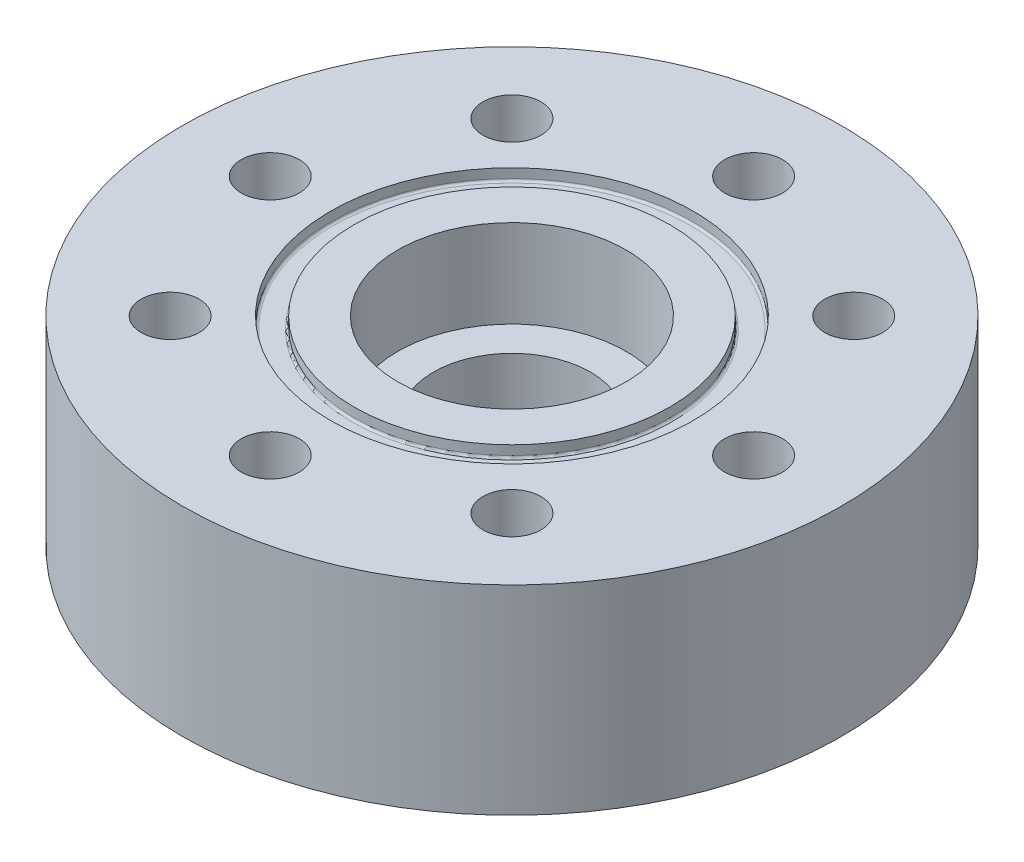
from build123d import *

# Parameters (mm, degrees)
SKETCH2_R                 = 37.5
OUTER_CYLINDER_DEPTH      = 22.7
SKETCH3_R                 = 8.93
NPT_HOLE_DEPTH            = 12.7
SKETCH4_R                 = 3.3
BOLT_HOLES_DEPTH          = 58.687000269
SKETCH5_R                 = 20.6375
SKETCH5_R_2               = 17.9705
O_RING_GROOVE_DEPTH       = 1.3208
FILLET1_R                 = 0.254
SKETCH6_R                 = 13
INLET_FLOW_DIAMETER_DEPTH = 10


with BuildPart() as part:
    # Sketch2 → Outer Cylinder (new body)
    with BuildSketch(Plane(origin=(0, 0, 0), x_dir=(1, 0, 0), z_dir=(0, 1, 0))):
        with Locations(Location((0, 0, 0), (0, 0, 270))):
            Circle(SKETCH2_R)
    extrude(amount=OUTER_CYLINDER_DEPTH)

    # Sketch3 → NPT Hole (cut)
    with BuildSketch(Plane.XZ):
        with Locations(Location((0, 0, 0), (0, 0, 270))):
            Circle(SKETCH3_R)
    extrude(amount=-NPT_HOLE_DEPTH, mode=Mode.SUBTRACT)

    # Sketch4 → Bolt Holes (cut, through all)
    with BuildSketch(Plane.XZ):
        with Locations(Location((-27.5, 0, 0), (0, 0, 270))):
            Circle(SKETCH4_R)
        with Locations(Location((-19.445436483, 19.445436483, 0), (0, 0, 270))):
            Circle(SKETCH4_R)
        with Locations(Location((0, 27.5, 0), (0, 0, 270))):
            Circle(SKETCH4_R)
        with Locations(Location((19.445436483, 19.445436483, 0), (0, 0, 270))):
            Circle(SKETCH4_R)
        with Locations(Location((27.5, 0, 0), (0, 0, 270))):
            Circle(SKETCH4_R)
        with Locations(Location((19.445436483, -19.445436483, 0), (0, 0, 270))):
            Circle(SKETCH4_R)
        with Locations(Location((0, -27.5, 0), (0, 0, 270))):
            Circle(SKETCH4_R)
        with Locations(Location((-19.445436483, -19.445436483, 0), (0, 0, 270))):
            Circle(SKETCH4_R)
    extrude(amount=-BOLT_HOLES_DEPTH, mode=Mode.SUBTRACT)

    # Sketch5 → O-Ring Groove (cut)
    with BuildSketch(Plane(origin=(0, 22.7, 0), x_dir=(1, 0, 0), z_dir=(0, 1, 0))):
        with Locations(Location((0, 0, 0), (0, 0, 270))):
            Circle(SKETCH5_R)
        with Locations(Location((0, 0, 0), (0, 0, 270))):
            Circle(SKETCH5_R_2, mode=Mode.SUBTRACT)
    extrude(amount=-O_RING_GROOVE_DEPTH, mode=Mode.SUBTRACT)

    # Fillet1
    fillet1_edges = [part.edges().sort_by_distance(p)[0] for p in [
        (0, 21.3792, -20.6375),
        (0, 21.3792, -17.9705),
    ]]
    fillet(fillet1_edges, radius=FILLET1_R)

    # Sketch6 → Inlet Flow Diameter (cut)
    with BuildSketch(Plane(origin=(0, 22.7, 0), x_dir=(1, 0, 0), z_dir=(0, 1, 0))):
        with Locations(Location((0, 0, 0), (0, 0, 270))):
            Circle(SKETCH6_R)
    extrude(amount=-INLET_FLOW_DIAMETER_DEPTH, mode=Mode.SUBTRACT)


solid = part.part
